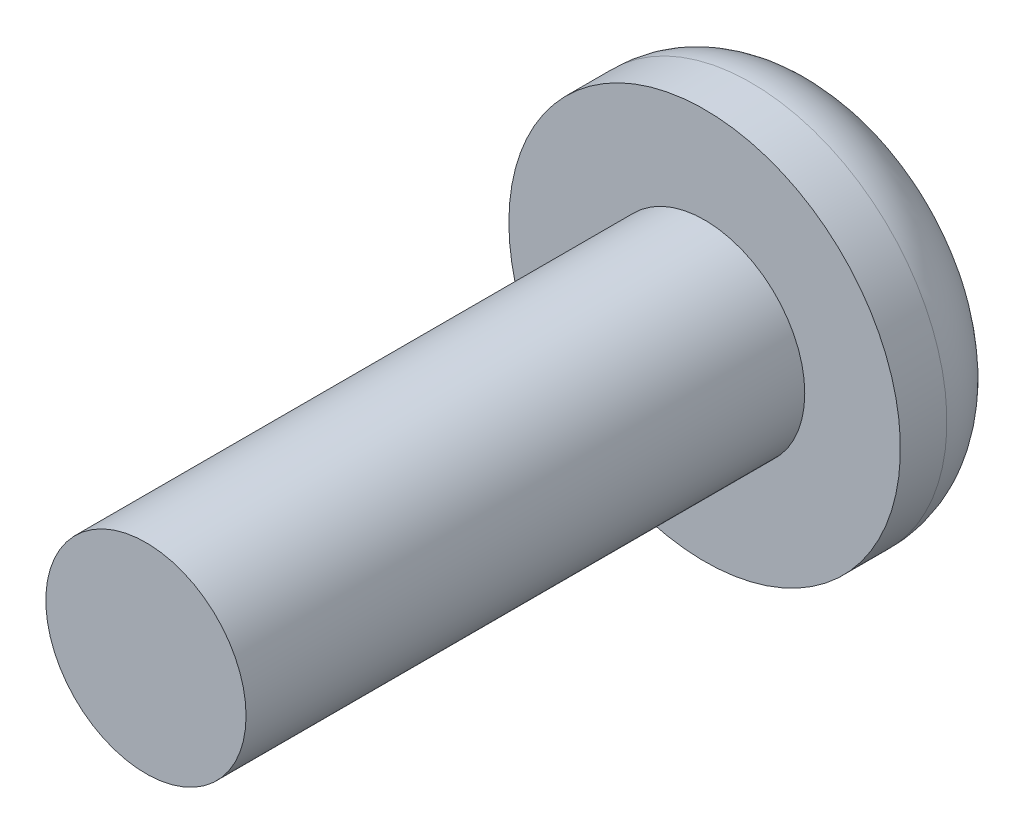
from build123d import *

# Parameters (mm, degrees)
SKETCH1_R          = 1.4224
THREADS_DEPTH      = 7.9375
SKETCH2_W          = 2.7813
SKETCH2_H          = 1.7272
FILLET_2_R         = 1.0668
SKETCH4_W          = 0.6858
SKETCH4_H          = 1.4224
CUT_EXTRUDE1_DEPTH = 0.8636
CIRPATTERN2_COUNT  = 4


with BuildPart() as part:
    # Sketch1 → THREADS (new body)
    with BuildSketch(Plane.XY):
        Circle(SKETCH1_R)
    extrude(amount=THREADS_DEPTH)

    # Sketch2 → PANHEAD (revolve)
    with BuildSketch(Plane(origin=(0, 0, 0), x_dir=(1, 0, 0), z_dir=(0, 1, 0)), mode=Mode.PRIVATE) as panhead_sk:
        with Locations((1.39065, 0.8636)):
            Rectangle(SKETCH2_W, SKETCH2_H)
    revolve(panhead_sk.sketch.rotate(Axis((0, 0, -4.840317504), (0, 0, 1)), 180), axis=Axis((0, 0, -4.840317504), (0, 0, 1)))

    # FILLET 2
    fillet_2_edges = [part.edges().sort_by_distance(p)[0] for p in [
        (2.7813, 0, -1.7272),
    ]]
    fillet(fillet_2_edges, radius=FILLET_2_R)

    # Sketch4 → Cut-Extrude1 (cut)
    with BuildSketch(Plane(origin=(-0.355935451, -0.850723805, -1.7272), x_dir=(-1, 0, 0), z_dir=(0, 0, -1))):
        with Locations((-0.355935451, 1.561923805)):
            Rectangle(SKETCH4_W, SKETCH4_H)
    cut_extrude1 = extrude(amount=-CUT_EXTRUDE1_DEPTH, mode=Mode.SUBTRACT)

    # CirPattern2: Cut-Extrude1 ×4 about axis
    cirpattern2_axis = Axis((0, 0, 0), (0, 0, 1))
    for i in range(1, CIRPATTERN2_COUNT):
        add(cut_extrude1.rotate(cirpattern2_axis, i * 360 / CIRPATTERN2_COUNT), mode=Mode.SUBTRACT)


solid = part.part
